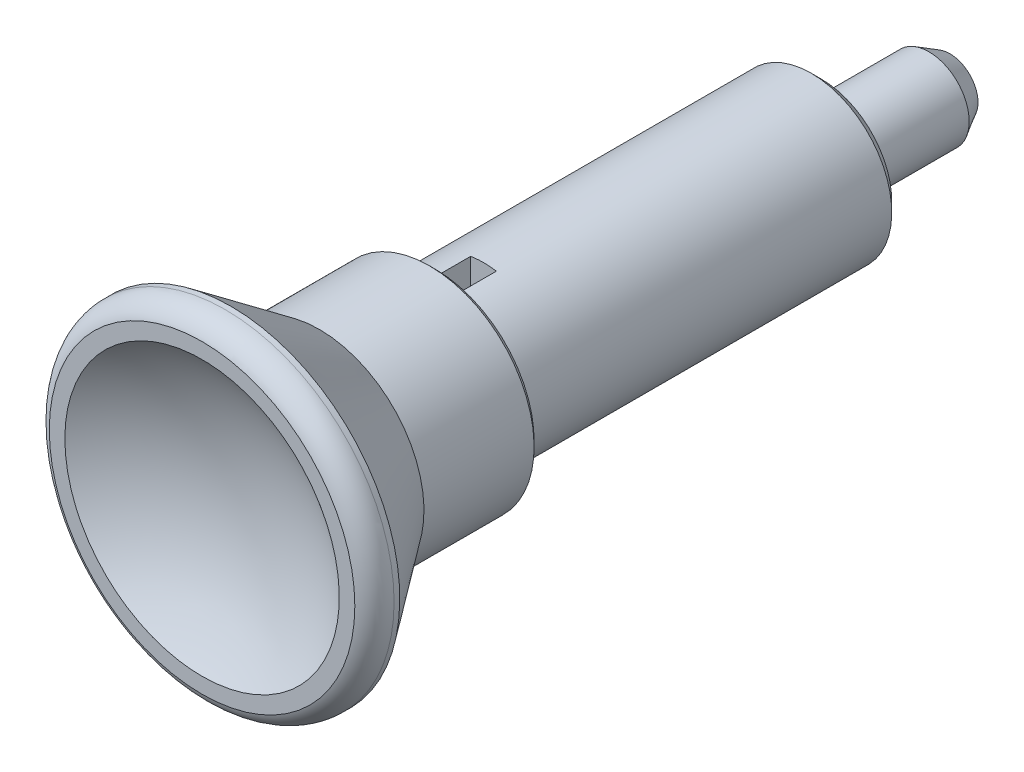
ISO-10303-21;
HEADER;
FILE_DESCRIPTION(('STEP AP214'),'2;1');
FILE_NAME('part.step','',(''),(''),'','','');
FILE_SCHEMA(('AUTOMOTIVE_DESIGN { 1 0 10303 214 1 1 1 1 }'));
ENDSEC;
DATA;
#1=APPLICATION_CONTEXT('core data for automotive mechanical design processes');
#2=APPLICATION_PROTOCOL_DEFINITION('international standard','automotive_design',2000,#1);
#3=PRODUCT_CONTEXT('',#1,'mechanical');
#4=PRODUCT('Part','Part','',(#3));
#5=PRODUCT_RELATED_PRODUCT_CATEGORY('part','',(#4));
#6=PRODUCT_DEFINITION_FORMATION('','',#4);
#7=PRODUCT_DEFINITION_CONTEXT('part definition',#1,'design');
#8=PRODUCT_DEFINITION('design','',#6,#7);
#9=PRODUCT_DEFINITION_SHAPE('','',#8);
#10=(LENGTH_UNIT() NAMED_UNIT(*) SI_UNIT(.MILLI.,.METRE.));
#11=(NAMED_UNIT(*) PLANE_ANGLE_UNIT() SI_UNIT($,.RADIAN.));
#12=(NAMED_UNIT(*) SI_UNIT($,.STERADIAN.) SOLID_ANGLE_UNIT());
#13=UNCERTAINTY_MEASURE_WITH_UNIT(LENGTH_MEASURE(1.E-05),#10,'distance_accuracy_value','');
#14=(GEOMETRIC_REPRESENTATION_CONTEXT(3) GLOBAL_UNCERTAINTY_ASSIGNED_CONTEXT((#13)) GLOBAL_UNIT_ASSIGNED_CONTEXT((#10,
#11,#12)) REPRESENTATION_CONTEXT('',''));
#15=CARTESIAN_POINT('',(0.,0.,0.));
#16=DIRECTION('',(0.,0.,1.));
#17=DIRECTION('',(1.,0.,0.));
#18=AXIS2_PLACEMENT_3D('',#15,#16,#17);
#19=CARTESIAN_POINT('',(0.8,13.,21.));
#20=DIRECTION('',(0.,0.,1.));
#21=DIRECTION('',(0.,1.,0.));
#22=AXIS2_PLACEMENT_3D('',#19,#20,#21);
#23=PLANE('',#22);
#24=DIRECTION('',(0.,-1.,0.));
#25=VECTOR('',#24,1.);
#26=CARTESIAN_POINT('',(0.8,13.,21.));
#27=LINE('',#26,#25);
#28=CARTESIAN_POINT('',(0.8,4.93558507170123,21.));
#29=VERTEX_POINT('',#28);
#30=CARTESIAN_POINT('',(0.8,2.3685438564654,21.));
#31=VERTEX_POINT('',#30);
#32=EDGE_CURVE('E88',#29,#31,#27,.T.);
#33=ORIENTED_EDGE('',*,*,#32,.F.);
#34=CARTESIAN_POINT('',(0.,0.,21.));
#35=DIRECTION('',(0.,0.,1.));
#36=DIRECTION('',(0.,1.,0.));
#37=AXIS2_PLACEMENT_3D('',#34,#35,#36);
#38=CIRCLE('',#37,5.);
#39=CARTESIAN_POINT('',(-0.8,4.93558507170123,21.));
#40=VERTEX_POINT('',#39);
#41=EDGE_CURVE('E248',#40,#29,#38,.F.);
#42=ORIENTED_EDGE('',*,*,#41,.F.);
#43=DIRECTION('',(0.,1.,0.));
#44=VECTOR('',#43,1.);
#45=CARTESIAN_POINT('',(-0.8,13.,21.));
#46=LINE('',#45,#44);
#47=CARTESIAN_POINT('',(-0.8,2.3685438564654,21.));
#48=VERTEX_POINT('',#47);
#49=EDGE_CURVE('E91',#48,#40,#46,.T.);
#50=ORIENTED_EDGE('',*,*,#49,.F.);
#51=CARTESIAN_POINT('',(0.,0.,21.));
#52=DIRECTION('',(0.,0.,1.));
#53=DIRECTION('',(0.,1.,0.));
#54=AXIS2_PLACEMENT_3D('',#51,#52,#53);
#55=CIRCLE('',#54,2.5);
#56=EDGE_CURVE('E85',#31,#48,#55,.T.);
#57=ORIENTED_EDGE('',*,*,#56,.F.);
#58=EDGE_LOOP('',(#33,#42,#50,#57));
#59=FACE_BOUND('',#58,.T.);
#60=ADVANCED_FACE('F14',(#59),#23,.T.);
#61=CARTESIAN_POINT('',(0.,0.,-8.));
#62=DIRECTION('',(0.,0.,1.));
#63=DIRECTION('',(0.,1.,0.));
#64=AXIS2_PLACEMENT_3D('',#61,#62,#63);
#65=CYLINDRICAL_SURFACE('',#64,2.5);
#66=DIRECTION('',(0.,0.,1.));
#67=VECTOR('',#66,1.);
#68=CARTESIAN_POINT('',(-0.8,2.3685438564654,21.));
#69=LINE('',#68,#67);
#70=CARTESIAN_POINT('',(-0.8,2.3685438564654,24.));
#71=VERTEX_POINT('',#70);
#72=EDGE_CURVE('E116',#71,#48,#69,.F.);
#73=ORIENTED_EDGE('',*,*,#72,.F.);
#74=CARTESIAN_POINT('',(0.,0.,24.));
#75=DIRECTION('',(0.,0.,1.));
#76=DIRECTION('',(0.,1.,0.));
#77=AXIS2_PLACEMENT_3D('',#74,#75,#76);
#78=CIRCLE('',#77,2.5);
#79=CARTESIAN_POINT('',(0.8,2.3685438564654,24.));
#80=VERTEX_POINT('',#79);
#81=EDGE_CURVE('E95',#71,#80,#78,.F.);
#82=ORIENTED_EDGE('',*,*,#81,.T.);
#83=DIRECTION('',(0.,0.,1.));
#84=VECTOR('',#83,1.);
#85=CARTESIAN_POINT('',(0.8,2.3685438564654,24.));
#86=LINE('',#85,#84);
#87=EDGE_CURVE('E99',#31,#80,#86,.T.);
#88=ORIENTED_EDGE('',*,*,#87,.F.);
#89=ORIENTED_EDGE('',*,*,#56,.T.);
#90=EDGE_LOOP('',(#73,#82,#88,#89));
#91=FACE_BOUND('',#90,.T.);
#92=ADVANCED_FACE('F100',(#91),#65,.T.);
#93=CARTESIAN_POINT('',(0.8,13.,21.));
#94=DIRECTION('',(0.,0.,1.));
#95=DIRECTION('',(0.,1.,0.));
#96=AXIS2_PLACEMENT_3D('',#93,#94,#95);
#97=PLANE('',#96);
#98=DIRECTION('',(0.,1.,0.));
#99=VECTOR('',#98,1.);
#100=CARTESIAN_POINT('',(-0.8,13.,21.));
#101=LINE('',#100,#99);
#102=CARTESIAN_POINT('',(-0.8,-4.93558507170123,21.));
#103=VERTEX_POINT('',#102);
#104=CARTESIAN_POINT('',(-0.8,-2.3685438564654,21.));
#105=VERTEX_POINT('',#104);
#106=EDGE_CURVE('E212',#103,#105,#101,.T.);
#107=ORIENTED_EDGE('',*,*,#106,.F.);
#108=CARTESIAN_POINT('',(0.,0.,21.));
#109=DIRECTION('',(0.,0.,1.));
#110=DIRECTION('',(0.,1.,0.));
#111=AXIS2_PLACEMENT_3D('',#108,#109,#110);
#112=CIRCLE('',#111,5.);
#113=CARTESIAN_POINT('',(0.8,-4.93558507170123,21.));
#114=VERTEX_POINT('',#113);
#115=EDGE_CURVE('E218',#114,#103,#112,.F.);
#116=ORIENTED_EDGE('',*,*,#115,.F.);
#117=DIRECTION('',(0.,-1.,0.));
#118=VECTOR('',#117,1.);
#119=CARTESIAN_POINT('',(0.8,13.,21.));
#120=LINE('',#119,#118);
#121=CARTESIAN_POINT('',(0.8,-2.3685438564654,21.));
#122=VERTEX_POINT('',#121);
#123=EDGE_CURVE('E215',#122,#114,#120,.T.);
#124=ORIENTED_EDGE('',*,*,#123,.F.);
#125=CARTESIAN_POINT('',(0.,0.,21.));
#126=DIRECTION('',(0.,0.,1.));
#127=DIRECTION('',(0.,1.,0.));
#128=AXIS2_PLACEMENT_3D('',#125,#126,#127);
#129=CIRCLE('',#128,2.5);
#130=EDGE_CURVE('E243',#105,#122,#129,.T.);
#131=ORIENTED_EDGE('',*,*,#130,.F.);
#132=EDGE_LOOP('',(#107,#116,#124,#131));
#133=FACE_BOUND('',#132,.T.);
#134=ADVANCED_FACE('F242',(#133),#97,.T.);
#135=CARTESIAN_POINT('',(0.,0.,-8.));
#136=DIRECTION('',(0.,0.,1.));
#137=DIRECTION('',(0.,1.,0.));
#138=AXIS2_PLACEMENT_3D('',#135,#136,#137);
#139=CYLINDRICAL_SURFACE('',#138,2.5);
#140=DIRECTION('',(0.,0.,1.));
#141=VECTOR('',#140,1.);
#142=CARTESIAN_POINT('',(-0.8,-2.3685438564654,21.));
#143=LINE('',#142,#141);
#144=CARTESIAN_POINT('',(-0.8,-2.3685438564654,24.));
#145=VERTEX_POINT('',#144);
#146=EDGE_CURVE('E209',#105,#145,#143,.T.);
#147=ORIENTED_EDGE('',*,*,#146,.F.);
#148=ORIENTED_EDGE('',*,*,#130,.T.);
#149=DIRECTION('',(0.,0.,1.));
#150=VECTOR('',#149,1.);
#151=CARTESIAN_POINT('',(0.8,-2.3685438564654,24.));
#152=LINE('',#151,#150);
#153=CARTESIAN_POINT('',(0.8,-2.3685438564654,24.));
#154=VERTEX_POINT('',#153);
#155=EDGE_CURVE('E213',#154,#122,#152,.F.);
#156=ORIENTED_EDGE('',*,*,#155,.F.);
#157=CARTESIAN_POINT('',(0.,0.,24.));
#158=DIRECTION('',(0.,0.,1.));
#159=DIRECTION('',(0.,1.,0.));
#160=AXIS2_PLACEMENT_3D('',#157,#158,#159);
#161=CIRCLE('',#160,2.5);
#162=EDGE_CURVE('E315',#154,#145,#161,.F.);
#163=ORIENTED_EDGE('',*,*,#162,.T.);
#164=EDGE_LOOP('',(#147,#148,#156,#163));
#165=FACE_BOUND('',#164,.T.);
#166=ADVANCED_FACE('F462',(#165),#139,.T.);
#167=CARTESIAN_POINT('',(0.,0.,0.));
#168=DIRECTION('',(0.,0.,1.));
#169=DIRECTION('',(0.,1.,0.));
#170=AXIS2_PLACEMENT_3D('',#167,#168,#169);
#171=CYLINDRICAL_SURFACE('',#170,5.);
#172=DIRECTION('',(0.,0.,1.));
#173=VECTOR('',#172,1.);
#174=CARTESIAN_POINT('',(0.8,-4.93558507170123,24.));
#175=LINE('',#174,#173);
#176=CARTESIAN_POINT('',(0.8,-4.93558507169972,23.3865000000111));
#177=VERTEX_POINT('',#176);
#178=EDGE_CURVE('E232',#114,#177,#175,.T.);
#179=ORIENTED_EDGE('',*,*,#178,.F.);
#180=ORIENTED_EDGE('',*,*,#115,.T.);
#181=DIRECTION('',(0.,0.,1.));
#182=VECTOR('',#181,1.);
#183=CARTESIAN_POINT('',(-0.8,-4.93558507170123,21.));
#184=LINE('',#183,#182);
#185=CARTESIAN_POINT('',(-0.8,-4.93558507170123,23.3865000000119));
#186=VERTEX_POINT('',#185);
#187=EDGE_CURVE('E211',#186,#103,#184,.F.);
#188=ORIENTED_EDGE('',*,*,#187,.F.);
#189=CARTESIAN_POINT('',(0.,0.,23.3865000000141));
#190=DIRECTION('',(0.,0.,-1.));
#191=DIRECTION('',(0.,-1.,0.));
#192=AXIS2_PLACEMENT_3D('',#189,#190,#191);
#193=CIRCLE('',#192,4.99999999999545);
#194=CARTESIAN_POINT('',(-0.8,4.93558507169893,23.3865000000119));
#195=VERTEX_POINT('',#194);
#196=EDGE_CURVE('E206',#195,#186,#193,.F.);
#197=ORIENTED_EDGE('',*,*,#196,.F.);
#198=DIRECTION('',(0.,0.,1.));
#199=VECTOR('',#198,1.);
#200=CARTESIAN_POINT('',(-0.8,4.93558507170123,21.));
#201=LINE('',#200,#199);
#202=EDGE_CURVE('E108',#40,#195,#201,.T.);
#203=ORIENTED_EDGE('',*,*,#202,.F.);
#204=ORIENTED_EDGE('',*,*,#41,.T.);
#205=DIRECTION('',(0.,0.,1.));
#206=VECTOR('',#205,1.);
#207=CARTESIAN_POINT('',(0.8,4.93558507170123,24.));
#208=LINE('',#207,#206);
#209=CARTESIAN_POINT('',(0.8,4.93558507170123,23.3865000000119));
#210=VERTEX_POINT('',#209);
#211=EDGE_CURVE('E103',#210,#29,#208,.F.);
#212=ORIENTED_EDGE('',*,*,#211,.F.);
#213=CARTESIAN_POINT('',(0.,0.,23.3865000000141));
#214=DIRECTION('',(0.,0.,-1.));
#215=DIRECTION('',(0.,-1.,0.));
#216=AXIS2_PLACEMENT_3D('',#213,#214,#215);
#217=CIRCLE('',#216,4.99999999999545);
#218=EDGE_CURVE('E229',#177,#210,#217,.F.);
#219=ORIENTED_EDGE('',*,*,#218,.F.);
#220=EDGE_LOOP('',(#179,#180,#188,#197,#203,#204,#212,#219));
#221=FACE_BOUND('',#220,.T.);
#222=CARTESIAN_POINT('',(0.,0.,0.6135));
#223=DIRECTION('',(0.,0.,1.));
#224=DIRECTION('',(0.,1.,0.));
#225=AXIS2_PLACEMENT_3D('',#222,#223,#224);
#226=CIRCLE('',#225,5.);
#227=CARTESIAN_POINT('',(0.,5.,0.6135));
#228=VERTEX_POINT('',#227);
#229=EDGE_CURVE('E96',#228,#228,#226,.T.);
#230=ORIENTED_EDGE('',*,*,#229,.T.);
#231=EDGE_LOOP('',(#230));
#232=FACE_BOUND('',#231,.T.);
#233=ADVANCED_FACE('F250',(#221,#232),#171,.T.);
#234=CARTESIAN_POINT('',(-0.8,13.,21.));
#235=DIRECTION('',(1.,0.,0.));
#236=DIRECTION('',(0.,1.,0.));
#237=AXIS2_PLACEMENT_3D('',#234,#235,#236);
#238=PLANE('',#237);
#239=ORIENTED_EDGE('',*,*,#202,.T.);
#240=CARTESIAN_POINT('',(-0.8,4.3129319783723,24.000000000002));
#241=CARTESIAN_POINT('',(-0.8,4.416807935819,23.8978519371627));
#242=CARTESIAN_POINT('',(-0.8,4.52063367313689,23.7956529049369));
#243=CARTESIAN_POINT('',(-0.8,4.72818470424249,23.5911529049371));
#244=CARTESIAN_POINT('',(-0.8,4.83190999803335,23.4888519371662));
#245=CARTESIAN_POINT('',(-0.8,4.93558507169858,23.3865000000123));
#246=B_SPLINE_CURVE_WITH_KNOTS('',3,(#240,#241,#242,#243,#244,#245),.UNSPECIFIED.,.F.,.F.,(4,2,
4),(0.,0.437058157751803,0.874116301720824),.UNSPECIFIED.);
#247=CARTESIAN_POINT('',(-0.8,4.31293197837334,24.0000000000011));
#248=VERTEX_POINT('',#247);
#249=EDGE_CURVE('E222',#248,#195,#246,.T.);
#250=ORIENTED_EDGE('',*,*,#249,.F.);
#251=DIRECTION('',(0.,1.,0.));
#252=VECTOR('',#251,1.);
#253=CARTESIAN_POINT('',(-0.8,0.,24.));
#254=LINE('',#253,#252);
#255=EDGE_CURVE('E204',#248,#71,#254,.F.);
#256=ORIENTED_EDGE('',*,*,#255,.T.);
#257=ORIENTED_EDGE('',*,*,#72,.T.);
#258=ORIENTED_EDGE('',*,*,#49,.T.);
#259=EDGE_LOOP('',(#239,#250,#256,#257,#258));
#260=FACE_BOUND('',#259,.T.);
#261=ADVANCED_FACE('F285',(#260),#238,.T.);
#262=CARTESIAN_POINT('',(0.8,13.,24.));
#263=DIRECTION('',(-1.,0.,0.));
#264=DIRECTION('',(0.,-1.,0.));
#265=AXIS2_PLACEMENT_3D('',#262,#263,#264);
#266=PLANE('',#265);
#267=CARTESIAN_POINT('',(0.8,4.93558507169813,23.3865000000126));
#268=CARTESIAN_POINT('',(0.8,4.83190999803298,23.4888519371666));
#269=CARTESIAN_POINT('',(0.8,4.7281847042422,23.5911529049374));
#270=CARTESIAN_POINT('',(0.8,4.52063367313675,23.795652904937));
#271=CARTESIAN_POINT('',(0.8,4.41680793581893,23.8978519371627));
#272=CARTESIAN_POINT('',(0.8,4.3129319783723,24.000000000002));
#273=B_SPLINE_CURVE_WITH_KNOTS('',3,(#267,#268,#269,#270,#271,#272),.UNSPECIFIED.,.F.,.F.,(4,2,
4),(0.,0.437058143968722,0.874116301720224),.UNSPECIFIED.);
#274=CARTESIAN_POINT('',(0.8,4.31293197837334,24.0000000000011));
#275=VERTEX_POINT('',#274);
#276=EDGE_CURVE('E216',#210,#275,#273,.T.);
#277=ORIENTED_EDGE('',*,*,#276,.F.);
#278=ORIENTED_EDGE('',*,*,#211,.T.);
#279=ORIENTED_EDGE('',*,*,#32,.T.);
#280=ORIENTED_EDGE('',*,*,#87,.T.);
#281=DIRECTION('',(0.,1.,0.));
#282=VECTOR('',#281,1.);
#283=CARTESIAN_POINT('',(0.8,0.,24.));
#284=LINE('',#283,#282);
#285=EDGE_CURVE('E202',#80,#275,#284,.T.);
#286=ORIENTED_EDGE('',*,*,#285,.T.);
#287=EDGE_LOOP('',(#277,#278,#279,#280,#286));
#288=FACE_BOUND('',#287,.T.);
#289=ADVANCED_FACE('F107',(#288),#266,.T.);
#290=CARTESIAN_POINT('',(0.,0.,23.3865000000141));
#291=DIRECTION('',(0.,0.,-1.));
#292=DIRECTION('',(0.,-1.,0.));
#293=AXIS2_PLACEMENT_3D('',#290,#291,#292);
#294=CONICAL_SURFACE('',#293,4.99999999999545,0.785398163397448);
#295=ORIENTED_EDGE('',*,*,#276,.T.);
#296=CARTESIAN_POINT('',(0.,0.,24.));
#297=DIRECTION('',(0.,0.,-1.));
#298=DIRECTION('',(0.,-1.,0.));
#299=AXIS2_PLACEMENT_3D('',#296,#297,#298);
#300=CIRCLE('',#299,4.38650000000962);
#301=CARTESIAN_POINT('',(0.8,-4.31293197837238,24.000000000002));
#302=VERTEX_POINT('',#301);
#303=EDGE_CURVE('E201',#275,#302,#300,.T.);
#304=ORIENTED_EDGE('',*,*,#303,.T.);
#305=CARTESIAN_POINT('',(0.8,-4.93558507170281,23.386500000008));
#306=CARTESIAN_POINT('',(0.8,-4.83190999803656,23.4888519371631));
#307=CARTESIAN_POINT('',(0.8,-4.72818470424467,23.5911529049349));
#308=CARTESIAN_POINT('',(0.8,-4.52063367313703,23.7956529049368));
#309=CARTESIAN_POINT('',(0.8,-4.4168079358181,23.8978519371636));
#310=CARTESIAN_POINT('',(0.8,-4.31293197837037,24.000000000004));
#311=B_SPLINE_CURVE_WITH_KNOTS('',3,(#305,#306,#307,#308,#309,#310),.UNSPECIFIED.,.F.,.F.,(4,2,
4),(0.,0.437058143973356,0.874116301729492),.UNSPECIFIED.);
#312=EDGE_CURVE('E228',#177,#302,#311,.T.);
#313=ORIENTED_EDGE('',*,*,#312,.F.);
#314=ORIENTED_EDGE('',*,*,#218,.T.);
#315=EDGE_LOOP('',(#295,#304,#313,#314));
#316=FACE_BOUND('',#315,.T.);
#317=ADVANCED_FACE('F255',(#316),#294,.T.);
#318=CARTESIAN_POINT('',(0.8,13.,24.));
#319=DIRECTION('',(-1.,0.,0.));
#320=DIRECTION('',(0.,-1.,0.));
#321=AXIS2_PLACEMENT_3D('',#318,#319,#320);
#322=PLANE('',#321);
#323=ORIENTED_EDGE('',*,*,#178,.T.);
#324=ORIENTED_EDGE('',*,*,#312,.T.);
#325=DIRECTION('',(0.,1.,0.));
#326=VECTOR('',#325,1.);
#327=CARTESIAN_POINT('',(0.8,0.,24.));
#328=LINE('',#327,#326);
#329=EDGE_CURVE('E198',#302,#154,#328,.T.);
#330=ORIENTED_EDGE('',*,*,#329,.T.);
#331=ORIENTED_EDGE('',*,*,#155,.T.);
#332=ORIENTED_EDGE('',*,*,#123,.T.);
#333=EDGE_LOOP('',(#323,#324,#330,#331,#332));
#334=FACE_BOUND('',#333,.T.);
#335=ADVANCED_FACE('F237',(#334),#322,.T.);
#336=CARTESIAN_POINT('',(-0.8,13.,21.));
#337=DIRECTION('',(1.,0.,0.));
#338=DIRECTION('',(0.,1.,0.));
#339=AXIS2_PLACEMENT_3D('',#336,#337,#338);
#340=PLANE('',#339);
#341=CARTESIAN_POINT('',(-0.8,-4.93558507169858,23.3865000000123));
#342=CARTESIAN_POINT('',(-0.8,-4.83190999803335,23.4888519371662));
#343=CARTESIAN_POINT('',(-0.8,-4.72818470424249,23.5911529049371));
#344=CARTESIAN_POINT('',(-0.8,-4.52063367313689,23.7956529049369));
#345=CARTESIAN_POINT('',(-0.8,-4.416807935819,23.8978519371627));
#346=CARTESIAN_POINT('',(-0.8,-4.3129319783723,24.000000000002));
#347=B_SPLINE_CURVE_WITH_KNOTS('',3,(#341,#342,#343,#344,#345,#346),.UNSPECIFIED.,.F.,.F.,(4,2,
4),(0.,0.437058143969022,0.874116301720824),.UNSPECIFIED.);
#348=CARTESIAN_POINT('',(-0.8,-4.31293197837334,24.0000000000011));
#349=VERTEX_POINT('',#348);
#350=EDGE_CURVE('E225',#186,#349,#347,.T.);
#351=ORIENTED_EDGE('',*,*,#350,.F.);
#352=ORIENTED_EDGE('',*,*,#187,.T.);
#353=ORIENTED_EDGE('',*,*,#106,.T.);
#354=ORIENTED_EDGE('',*,*,#146,.T.);
#355=DIRECTION('',(0.,1.,0.));
#356=VECTOR('',#355,1.);
#357=CARTESIAN_POINT('',(-0.8,0.,24.));
#358=LINE('',#357,#356);
#359=EDGE_CURVE('E33',#145,#349,#358,.F.);
#360=ORIENTED_EDGE('',*,*,#359,.T.);
#361=EDGE_LOOP('',(#351,#352,#353,#354,#360));
#362=FACE_BOUND('',#361,.T.);
#363=ADVANCED_FACE('F298',(#362),#340,.T.);
#364=CARTESIAN_POINT('',(0.,0.,23.3865000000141));
#365=DIRECTION('',(0.,0.,-1.));
#366=DIRECTION('',(0.,-1.,0.));
#367=AXIS2_PLACEMENT_3D('',#364,#365,#366);
#368=CONICAL_SURFACE('',#367,4.99999999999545,0.785398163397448);
#369=ORIENTED_EDGE('',*,*,#249,.T.);
#370=ORIENTED_EDGE('',*,*,#196,.T.);
#371=ORIENTED_EDGE('',*,*,#350,.T.);
#372=CARTESIAN_POINT('',(0.,0.,24.));
#373=DIRECTION('',(0.,0.,-1.));
#374=DIRECTION('',(0.,-1.,0.));
#375=AXIS2_PLACEMENT_3D('',#372,#373,#374);
#376=CIRCLE('',#375,4.38650000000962);
#377=EDGE_CURVE('E143',#349,#248,#376,.T.);
#378=ORIENTED_EDGE('',*,*,#377,.T.);
#379=EDGE_LOOP('',(#369,#370,#371,#378));
#380=FACE_BOUND('',#379,.T.);
#381=ADVANCED_FACE('F165',(#380),#368,.T.);
#382=CARTESIAN_POINT('',(0.,0.,49.6));
#383=DIRECTION('',(1.,0.,0.));
#384=DIRECTION('',(0.,-1.,0.));
#385=AXIS2_PLACEMENT_3D('',#382,#383,#384);
#386=SPHERICAL_SURFACE('',#385,14.);
#387=CARTESIAN_POINT('',(0.,-8.53170557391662,38.5));
#388=CARTESIAN_POINT('',(0.239701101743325,-8.5317072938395,38.5));
#389=CARTESIAN_POINT('',(0.47937397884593,-8.52159969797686,38.5));
#390=CARTESIAN_POINT('',(0.957096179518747,-8.48123987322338,38.5));
#391=CARTESIAN_POINT('',(1.19514505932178,-8.45098234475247,38.5));
#392=CARTESIAN_POINT('',(1.66809840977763,-8.37048717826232,38.5));
#393=CARTESIAN_POINT('',(1.90299924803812,-8.3202282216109,38.5));
#394=CARTESIAN_POINT('',(2.36773233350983,-8.20008811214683,38.5));
#395=CARTESIAN_POINT('',(2.59756451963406,-8.13020672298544,38.5));
#396=CARTESIAN_POINT('',(3.05040854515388,-7.97135842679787,38.5));
#397=CARTESIAN_POINT('',(3.27342368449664,-7.88240092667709,38.5));
#398=CARTESIAN_POINT('',(3.71116976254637,-7.68601114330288,38.5));
#399=CARTESIAN_POINT('',(3.92590057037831,-7.57857856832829,38.5));
#400=CARTESIAN_POINT('',(4.34545679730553,-7.34605366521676,38.5));
#401=CARTESIAN_POINT('',(4.55028643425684,-7.22096894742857,38.5));
#402=CARTESIAN_POINT('',(4.94875279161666,-6.95394741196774,38.5));
#403=CARTESIAN_POINT('',(5.1423856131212,-6.81200477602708,38.5));
#404=CARTESIAN_POINT('',(5.51699044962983,-6.5123226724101,38.5));
#405=CARTESIAN_POINT('',(5.69796342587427,-6.35458440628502,38.5));
#406=CARTESIAN_POINT('',(6.04598097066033,-6.02442080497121,38.5));
#407=CARTESIAN_POINT('',(6.21302532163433,-5.85199524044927,38.5));
#408=CARTESIAN_POINT('',(6.53199815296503,-5.493681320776,38.5));
#409=CARTESIAN_POINT('',(6.6839263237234,-5.30779269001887,38.5));
#410=CARTESIAN_POINT('',(6.97158596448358,-4.92387306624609,38.5));
#411=CARTESIAN_POINT('',(7.10731707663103,-4.72584180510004,38.5));
#412=CARTESIAN_POINT('',(7.36158785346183,-4.31908993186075,38.5));
#413=CARTESIAN_POINT('',(7.48013099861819,-4.11037149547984,38.5));
#414=CARTESIAN_POINT('',(7.69925411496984,-3.68361770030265,38.5));
#415=CARTESIAN_POINT('',(7.79982785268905,-3.46557914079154,38.5));
#416=CARTESIAN_POINT('',(7.98222972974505,-3.02184395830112,38.5));
#417=CARTESIAN_POINT('',(8.06406129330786,-2.79614874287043,38.5));
#418=CARTESIAN_POINT('',(8.20842175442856,-2.33866337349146,38.5));
#419=CARTESIAN_POINT('',(8.27095035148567,-2.10687312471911,38.5));
#420=CARTESIAN_POINT('',(8.37625770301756,-1.63885297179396,38.5));
#421=CARTESIAN_POINT('',(8.41903679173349,-1.40262314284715,38.5));
#422=CARTESIAN_POINT('',(8.48454328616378,-0.927394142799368,38.5));
#423=CARTESIAN_POINT('',(8.5072702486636,-0.688394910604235,38.5));
#424=CARTESIAN_POINT('',(8.53250695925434,-0.209376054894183,38.5));
#425=CARTESIAN_POINT('',(8.53502046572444,0.0306433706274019,38.5));
#426=CARTESIAN_POINT('',(8.51981962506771,0.510124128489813,38.5));
#427=CARTESIAN_POINT('',(8.50209827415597,0.749585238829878,38.5));
#428=CARTESIAN_POINT('',(8.44654739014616,1.22611973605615,38.5));
#429=CARTESIAN_POINT('',(8.40872148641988,1.46319354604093,38.5));
#430=CARTESIAN_POINT('',(8.31323191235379,1.93331562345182,38.5));
#431=CARTESIAN_POINT('',(8.25556793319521,2.16636382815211,38.5));
#432=CARTESIAN_POINT('',(8.12081350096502,2.62676991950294,38.5));
#433=CARTESIAN_POINT('',(8.04372339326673,2.85412790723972,38.5));
#434=CARTESIAN_POINT('',(7.87066231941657,3.30154649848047,38.5));
#435=CARTESIAN_POINT('',(7.77469093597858,3.52160694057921,38.5));
#436=CARTESIAN_POINT('',(7.56457013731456,3.95282077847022,38.5));
#437=CARTESIAN_POINT('',(7.45042407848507,4.16397580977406,38.5));
#438=CARTESIAN_POINT('',(7.20470986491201,4.57599267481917,38.5));
#439=CARTESIAN_POINT('',(7.07313569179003,4.77685091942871,38.5));
#440=CARTESIAN_POINT('',(6.79355690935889,5.16673175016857,38.5));
#441=CARTESIAN_POINT('',(6.64555528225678,5.35575647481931,38.5));
#442=CARTESIAN_POINT('',(6.33415193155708,5.72066897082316,38.5));
#443=CARTESIAN_POINT('',(6.17074996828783,5.89655653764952,38.5));
#444=CARTESIAN_POINT('',(5.82971281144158,6.23393780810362,38.5));
#445=CARTESIAN_POINT('',(5.65207788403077,6.3954317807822,38.5));
#446=CARTESIAN_POINT('',(5.28383088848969,6.70288487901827,38.5));
#447=CARTESIAN_POINT('',(5.09321853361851,6.84884366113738,38.5));
#448=CARTESIAN_POINT('',(4.70041160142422,7.1241591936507,38.5));
#449=CARTESIAN_POINT('',(4.49821916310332,7.25351899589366,38.5));
#450=CARTESIAN_POINT('',(4.08358517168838,7.49479054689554,38.5));
#451=CARTESIAN_POINT('',(3.87114009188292,7.60669623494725,38.5));
#452=CARTESIAN_POINT('',(3.43761429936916,7.81219183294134,38.5));
#453=CARTESIAN_POINT('',(3.21653509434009,7.90578492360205,38.5));
#454=CARTESIAN_POINT('',(2.76727776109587,8.07401431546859,38.5));
#455=CARTESIAN_POINT('',(2.53909962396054,8.14865059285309,38.5));
#456=CARTESIAN_POINT('',(2.07727024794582,8.27843463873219,38.5));
#457=CARTESIAN_POINT('',(1.84361908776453,8.33358268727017,38.5));
#458=CARTESIAN_POINT('',(1.37249510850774,8.42400095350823,38.5));
#459=CARTESIAN_POINT('',(1.13502218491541,8.45927062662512,38.5));
#460=CARTESIAN_POINT('',(0.657949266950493,8.50967905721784,38.5));
#461=CARTESIAN_POINT('',(0.4183492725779,8.52481781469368,38.5));
#462=CARTESIAN_POINT('',(-0.0612677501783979,8.53485664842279,38.5));
#463=CARTESIAN_POINT('',(-0.301284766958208,8.52975727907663,38.5));
#464=CARTESIAN_POINT('',(-0.780039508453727,8.49935713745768,38.5));
#465=CARTESIAN_POINT('',(-1.01877721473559,8.47405607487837,38.5));
#466=CARTESIAN_POINT('',(-1.49327224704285,8.40343211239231,38.5));
#467=CARTESIAN_POINT('',(-1.72902957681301,8.3581092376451,38.5));
#468=CARTESIAN_POINT('',(-2.19592874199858,8.24775425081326,38.5));
#469=CARTESIAN_POINT('',(-2.42706976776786,8.18271871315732,38.5));
#470=CARTESIAN_POINT('',(-2.88297114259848,8.0334295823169,38.5));
#471=CARTESIAN_POINT('',(-3.10773367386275,7.94918265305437,38.5));
#472=CARTESIAN_POINT('',(-3.54940485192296,7.76203966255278,38.5));
#473=CARTESIAN_POINT('',(-3.76631204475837,7.65914016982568,38.5));
#474=CARTESIAN_POINT('',(-4.1906820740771,7.43543649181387,38.5));
#475=CARTESIAN_POINT('',(-4.39814511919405,7.31463270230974,38.5));
#476=CARTESIAN_POINT('',(-4.80216087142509,7.0559751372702,38.5));
#477=CARTESIAN_POINT('',(-4.99871337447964,6.91812104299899,38.5));
#478=CARTESIAN_POINT('',(-5.37950346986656,6.62634702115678,38.5));
#479=CARTESIAN_POINT('',(-5.56374125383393,6.47242734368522,38.5));
#480=CARTESIAN_POINT('',(-5.91862768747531,6.14958531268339,38.5));
#481=CARTESIAN_POINT('',(-6.08927386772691,5.98066024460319,38.5));
#482=CARTESIAN_POINT('',(-6.41566976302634,5.62909362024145,38.5));
#483=CARTESIAN_POINT('',(-6.57142461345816,5.44645683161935,38.5));
#484=CARTESIAN_POINT('',(-6.86702506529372,5.06867846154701,38.5));
#485=CARTESIAN_POINT('',(-7.00686772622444,4.873534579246,38.5));
#486=CARTESIAN_POINT('',(-7.26961345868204,4.47216416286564,38.5));
#487=CARTESIAN_POINT('',(-7.39251690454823,4.26593787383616,38.5));
#488=CARTESIAN_POINT('',(-7.62051616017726,3.84386102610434,38.5));
#489=CARTESIAN_POINT('',(-7.72561165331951,3.62801029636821,38.5));
#490=CARTESIAN_POINT('',(-7.91724365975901,3.18822603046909,38.5));
#491=CARTESIAN_POINT('',(-8.00378046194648,2.96429262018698,38.5));
#492=CARTESIAN_POINT('',(-8.15769585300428,2.5098907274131,38.5));
#493=CARTESIAN_POINT('',(-8.22507098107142,2.27942107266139,38.5));
#494=CARTESIAN_POINT('',(-8.34014309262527,1.8137052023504,38.5));
#495=CARTESIAN_POINT('',(-8.38784687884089,1.57846066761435,38.5));
#496=CARTESIAN_POINT('',(-8.46327786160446,1.10474543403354,38.5));
#497=CARTESIAN_POINT('',(-8.49100134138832,0.866274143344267,38.5));
#498=CARTESIAN_POINT('',(-8.52625974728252,0.387849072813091,38.5));
#499=CARTESIAN_POINT('',(-8.53379511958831,0.147895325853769,38.5));
#500=CARTESIAN_POINT('',(-8.5286249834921,-0.331798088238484,38.5));
#501=CARTESIAN_POINT('',(-8.51591913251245,-0.571537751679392,38.5));
#502=CARTESIAN_POINT('',(-8.4703566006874,-1.04909074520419,38.5));
#503=CARTESIAN_POINT('',(-8.43750023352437,-1.28690410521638,38.5));
#504=CARTESIAN_POINT('',(-8.35186267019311,-1.75896084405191,38.5));
#505=CARTESIAN_POINT('',(-8.29907783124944,-1.99320356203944,38.5));
#506=CARTESIAN_POINT('',(-8.17398097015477,-2.45632829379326,38.5));
#507=CARTESIAN_POINT('',(-8.10167571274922,-2.68521213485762,38.5));
#508=CARTESIAN_POINT('',(-7.93802712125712,-3.1361221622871,38.5));
#509=CARTESIAN_POINT('',(-7.84667992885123,-3.35814694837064,38.5));
#510=CARTESIAN_POINT('',(-7.64560805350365,-3.79370687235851,38.5));
#511=CARTESIAN_POINT('',(-7.53588377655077,-4.00724219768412,38.5));
#512=CARTESIAN_POINT('',(-7.29883882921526,-4.42430601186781,38.5));
#513=CARTESIAN_POINT('',(-7.1715185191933,-4.62783470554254,38.5));
#514=CARTESIAN_POINT('',(-6.90018708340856,-5.02343989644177,38.5));
#515=CARTESIAN_POINT('',(-6.75617621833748,-5.21551657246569,38.5));
#516=CARTESIAN_POINT('',(-6.45247425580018,-5.58686986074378,38.5));
#517=CARTESIAN_POINT('',(-6.29278196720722,-5.76614549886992,38.5));
#518=CARTESIAN_POINT('',(-5.95891965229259,-6.11054627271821,38.5));
#519=CARTESIAN_POINT('',(-5.78475465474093,-6.27567628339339,38.5));
#520=CARTESIAN_POINT('',(-5.42305871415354,-6.5907497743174,38.5));
#521=CARTESIAN_POINT('',(-5.23552205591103,-6.74068669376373,38.5));
#522=CARTESIAN_POINT('',(-4.84848604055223,-7.02422451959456,38.5));
#523=CARTESIAN_POINT('',(-4.64898687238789,-7.15782568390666,38.5));
#524=CARTESIAN_POINT('',(-4.23934049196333,-7.40780635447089,38.5));
#525=CARTESIAN_POINT('',(-4.02918808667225,-7.5241773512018,38.5));
#526=CARTESIAN_POINT('',(-3.59982553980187,-7.73878930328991,38.5));
#527=CARTESIAN_POINT('',(-3.38061550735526,-7.83703047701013,38.5));
#528=CARTESIAN_POINT('',(-2.93492880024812,-8.01459089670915,38.5));
#529=CARTESIAN_POINT('',(-2.7084601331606,-8.09393023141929,38.5));
#530=CARTESIAN_POINT('',(-2.24972197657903,-8.23323823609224,38.5));
#531=CARTESIAN_POINT('',(-2.01745402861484,-8.29321199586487,38.5));
#532=CARTESIAN_POINT('',(-1.49030380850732,-8.40586518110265,38.5));
#533=CARTESIAN_POINT('',(-1.1942237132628,-8.45301528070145,38.5));
#534=CARTESIAN_POINT('',(-0.598747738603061,-8.51593440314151,38.5));
#535=CARTESIAN_POINT('',(-0.29935185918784,-8.53170342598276,38.5));
#536=CARTESIAN_POINT('',(0.,-8.53170557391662,38.5));
#537=B_SPLINE_CURVE_WITH_KNOTS('',3,(#387,#388,#389,#390,#391,#392,#393,#394,#395,#396,#397,
#398,#399,#400,#401,#402,#403,#404,#405,#406,#407,#408,#409,#410,#411,#412,#413,#414,#415,#416,
#417,#418,#419,#420,#421,#422,#423,#424,#425,#426,#427,#428,#429,#430,#431,#432,#433,#434,#435,
#436,#437,#438,#439,#440,#441,#442,#443,#444,#445,#446,#447,#448,#449,#450,#451,#452,#453,#454,
#455,#456,#457,#458,#459,#460,#461,#462,#463,#464,#465,#466,#467,#468,#469,#470,#471,#472,#473,
#474,#475,#476,#477,#478,#479,#480,#481,#482,#483,#484,#485,#486,#487,#488,#489,#490,#491,#492,
#493,#494,#495,#496,#497,#498,#499,#500,#501,#502,#503,#504,#505,#506,#507,#508,#509,#510,#511,
#512,#513,#514,#515,#516,#517,#518,#519,#520,#521,#522,#523,#524,#525,#526,#527,#528,#529,#530,
#531,#532,#533,#534,#535,#536),.UNSPECIFIED.,.T.,.F.,(4,2,2,2,2,2,2,2,2,2,2,2,2,2,2,2,2,2,2,2,2,
2,2,2,2,2,2,2,2,2,2,2,2,2,2,2,2,2,2,2,2,2,2,2,2,2,2,2,2,2,2,2,2,2,2,2,2,2,2,2,2,2,2,2,2,2,2,2,2,
2,2,2,2,2,4),(0.,0.718841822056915,1.43787277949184,2.15767218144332,2.87748025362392,
3.59693418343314,4.31639947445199,5.03555552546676,5.75496050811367,6.47431080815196,
7.19367234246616,7.9130486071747,8.63244076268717,9.35168704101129,10.0711823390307,
10.790546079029,11.5099210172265,12.2292837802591,12.9486624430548,13.6679073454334,
14.387401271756,15.1067653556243,15.8261406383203,16.5455031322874,17.2648815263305,
17.9841272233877,18.7036219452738,19.422986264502,20.1423617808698,20.8617238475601,
21.5811018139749,22.3003473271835,23.0198420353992,23.7392116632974,24.4585821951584,
25.1779423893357,25.8973222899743,26.616702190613,27.3360623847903,28.0554329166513,
28.7748025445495,29.4942972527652,30.2135427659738,30.9329207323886,31.6522827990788,
32.3716583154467,33.0910226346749,33.8105173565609,34.5297630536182,35.2491414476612,
35.9685039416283,36.6878792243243,37.4072433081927,38.1267372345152,38.8459821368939,
39.5653607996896,40.2847235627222,41.0040985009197,41.7234622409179,42.4429575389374,
43.1622038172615,43.881595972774,44.6009722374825,45.3203337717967,46.039684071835,
46.7590890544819,47.4782451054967,48.1977103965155,48.9171643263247,49.6369723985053,
50.3567718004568,51.0758027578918,51.7946445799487,52.6923736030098,53.5901026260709),.UNSPECIFIED.);
#538=CARTESIAN_POINT('',(0.,-8.53170557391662,38.5));
#539=VERTEX_POINT('',#538);
#540=EDGE_CURVE('E135',#539,#539,#537,.T.);
#541=ORIENTED_EDGE('',*,*,#540,.T.);
#542=EDGE_LOOP('',(#541));
#543=FACE_BOUND('',#542,.T.);
#544=ADVANCED_FACE('F145',(#543),#386,.F.);
#545=CARTESIAN_POINT('',(-6.14644660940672,0.,24.));
#546=DIRECTION('',(0.,0.,1.));
#547=DIRECTION('',(0.,1.,0.));
#548=AXIS2_PLACEMENT_3D('',#545,#546,#547);
#549=PLANE('',#548);
#550=CARTESIAN_POINT('',(0.,0.,24.));
#551=DIRECTION('',(0.,0.,1.));
#552=DIRECTION('',(0.,1.,0.));
#553=AXIS2_PLACEMENT_3D('',#550,#551,#552);
#554=CIRCLE('',#553,6.14644660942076);
#555=CARTESIAN_POINT('',(0.,6.14644660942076,24.));
#556=VERTEX_POINT('',#555);
#557=EDGE_CURVE('E132',#556,#556,#554,.T.);
#558=ORIENTED_EDGE('',*,*,#557,.F.);
#559=EDGE_LOOP('',(#558));
#560=FACE_BOUND('',#559,.T.);
#561=ORIENTED_EDGE('',*,*,#359,.F.);
#562=ORIENTED_EDGE('',*,*,#162,.F.);
#563=ORIENTED_EDGE('',*,*,#329,.F.);
#564=ORIENTED_EDGE('',*,*,#303,.F.);
#565=ORIENTED_EDGE('',*,*,#285,.F.);
#566=ORIENTED_EDGE('',*,*,#81,.F.);
#567=ORIENTED_EDGE('',*,*,#255,.F.);
#568=ORIENTED_EDGE('',*,*,#377,.F.);
#569=EDGE_LOOP('',(#561,#562,#563,#564,#565,#566,#567,#568));
#570=FACE_BOUND('',#569,.T.);
#571=ADVANCED_FACE('F155',(#560,#570),#549,.F.);
#572=CARTESIAN_POINT('',(-8.53170557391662,0.,38.5));
#573=DIRECTION('',(0.,0.,-1.));
#574=DIRECTION('',(0.,-1.,0.));
#575=AXIS2_PLACEMENT_3D('',#572,#573,#574);
#576=PLANE('',#575);
#577=ORIENTED_EDGE('',*,*,#540,.F.);
#578=EDGE_LOOP('',(#577));
#579=FACE_BOUND('',#578,.T.);
#580=CARTESIAN_POINT('',(0.,0.,38.5));
#581=DIRECTION('',(0.,0.,-1.));
#582=DIRECTION('',(0.,-1.,0.));
#583=AXIS2_PLACEMENT_3D('',#580,#581,#582);
#584=CIRCLE('',#583,9.50000000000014);
#585=CARTESIAN_POINT('',(0.,-9.50000000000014,38.5));
#586=VERTEX_POINT('',#585);
#587=EDGE_CURVE('E128',#586,#586,#584,.T.);
#588=ORIENTED_EDGE('',*,*,#587,.F.);
#589=EDGE_LOOP('',(#588));
#590=FACE_BOUND('',#589,.T.);
#591=ADVANCED_FACE('F150',(#579,#590),#576,.F.);
#592=CARTESIAN_POINT('',(0.,0.,24.3535533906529));
#593=DIRECTION('',(0.,0.,1.));
#594=DIRECTION('',(0.,1.,0.));
#595=AXIS2_PLACEMENT_3D('',#592,#593,#594);
#596=CONICAL_SURFACE('',#595,6.50000000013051,0.785398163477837);
#597=CARTESIAN_POINT('',(0.,0.,24.3535533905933));
#598=DIRECTION('',(0.,0.,1.));
#599=DIRECTION('',(0.,1.,0.));
#600=AXIS2_PLACEMENT_3D('',#597,#598,#599);
#601=CIRCLE('',#600,6.5);
#602=CARTESIAN_POINT('',(0.,6.5,24.3535533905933));
#603=VERTEX_POINT('',#602);
#604=EDGE_CURVE('E131',#603,#603,#601,.T.);
#605=ORIENTED_EDGE('',*,*,#604,.F.);
#606=EDGE_LOOP('',(#605));
#607=FACE_BOUND('',#606,.T.);
#608=ORIENTED_EDGE('',*,*,#557,.T.);
#609=EDGE_LOOP('',(#608));
#610=FACE_BOUND('',#609,.T.);
#611=ADVANCED_FACE('F154',(#607,#610),#596,.T.);
#612=CARTESIAN_POINT('',(0.,0.,37.0857085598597));
#613=DIRECTION('',(0.,0.,-1.));
#614=DIRECTION('',(0.,-1.,0.));
#615=AXIS2_PLACEMENT_3D('',#612,#613,#614);
#616=TOROIDAL_SURFACE('',#615,9.0002203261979,1.5);
#617=CARTESIAN_POINT('',(0.,0.,37.06));
#618=DIRECTION('',(0.,0.,1.));
#619=DIRECTION('',(0.,1.,0.));
#620=AXIS2_PLACEMENT_3D('',#617,#618,#619);
#621=CIRCLE('',#620,10.5);
#622=CARTESIAN_POINT('',(0.,10.5,37.06));
#623=VERTEX_POINT('',#622);
#624=EDGE_CURVE('E502',#623,#623,#621,.F.);
#625=ORIENTED_EDGE('',*,*,#624,.F.);
#626=EDGE_LOOP('',(#625));
#627=FACE_BOUND('',#626,.T.);
#628=ORIENTED_EDGE('',*,*,#587,.T.);
#629=EDGE_LOOP('',(#628));
#630=FACE_BOUND('',#629,.T.);
#631=ADVANCED_FACE('F187',(#627,#630),#616,.T.);
#632=CARTESIAN_POINT('',(0.,0.,-8.));
#633=DIRECTION('',(0.,0.,1.));
#634=DIRECTION('',(0.,1.,0.));
#635=AXIS2_PLACEMENT_3D('',#632,#633,#634);
#636=CYLINDRICAL_SURFACE('',#635,6.5);
#637=CARTESIAN_POINT('',(0.,0.,31.2));
#638=DIRECTION('',(0.,0.,1.));
#639=DIRECTION('',(0.,1.,0.));
#640=AXIS2_PLACEMENT_3D('',#637,#638,#639);
#641=CIRCLE('',#640,6.5);
#642=CARTESIAN_POINT('',(0.,6.5,31.2));
#643=VERTEX_POINT('',#642);
#644=EDGE_CURVE('E24',#643,#643,#641,.T.);
#645=ORIENTED_EDGE('',*,*,#644,.F.);
#646=EDGE_LOOP('',(#645));
#647=FACE_BOUND('',#646,.T.);
#648=ORIENTED_EDGE('',*,*,#604,.T.);
#649=EDGE_LOOP('',(#648));
#650=FACE_BOUND('',#649,.T.);
#651=ADVANCED_FACE('F181',(#647,#650),#636,.T.);
#652=CARTESIAN_POINT('',(0.,0.,-8.));
#653=DIRECTION('',(0.,0.,1.));
#654=DIRECTION('',(0.,1.,0.));
#655=AXIS2_PLACEMENT_3D('',#652,#653,#654);
#656=CYLINDRICAL_SURFACE('',#655,10.5);
#657=ORIENTED_EDGE('',*,*,#624,.T.);
#658=EDGE_LOOP('',(#657));
#659=FACE_BOUND('',#658,.T.);
#660=CARTESIAN_POINT('',(0.,0.,36.7055276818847));
#661=DIRECTION('',(0.,0.,1.));
#662=DIRECTION('',(0.,1.,0.));
#663=AXIS2_PLACEMENT_3D('',#660,#661,#662);
#664=CIRCLE('',#663,10.5);
#665=CARTESIAN_POINT('',(0.,10.5,36.7055276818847));
#666=VERTEX_POINT('',#665);
#667=EDGE_CURVE('E9',#666,#666,#664,.F.);
#668=ORIENTED_EDGE('',*,*,#667,.F.);
#669=EDGE_LOOP('',(#668));
#670=FACE_BOUND('',#669,.T.);
#671=ADVANCED_FACE('F171',(#659,#670),#656,.T.);
#672=CARTESIAN_POINT('',(0.,0.,36.7055276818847));
#673=DIRECTION('',(0.,0.,1.));
#674=DIRECTION('',(0.,1.,0.));
#675=AXIS2_PLACEMENT_3D('',#672,#673,#674);
#676=CONICAL_SURFACE('',#675,10.5,0.628318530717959);
#677=ORIENTED_EDGE('',*,*,#667,.T.);
#678=EDGE_LOOP('',(#677));
#679=FACE_BOUND('',#678,.T.);
#680=ORIENTED_EDGE('',*,*,#644,.T.);
#681=EDGE_LOOP('',(#680));
#682=FACE_BOUND('',#681,.T.);
#683=ADVANCED_FACE('F169',(#679,#682),#676,.T.);
#684=CARTESIAN_POINT('',(-1.74944465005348,0.,-8.));
#685=DIRECTION('',(0.,0.,1.));
#686=DIRECTION('',(0.,1.,0.));
#687=AXIS2_PLACEMENT_3D('',#684,#685,#686);
#688=PLANE('',#687);
#689=CARTESIAN_POINT('',(0.,0.,-7.99999999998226));
#690=DIRECTION('',(0.,0.,1.));
#691=DIRECTION('',(1.,0.,0.));
#692=AXIS2_PLACEMENT_3D('',#689,#690,#691);
#693=CIRCLE('',#692,1.749444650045);
#694=CARTESIAN_POINT('',(1.749444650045,0.,-7.99999999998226));
#695=VERTEX_POINT('',#694);
#696=EDGE_CURVE('E18',#695,#695,#693,.T.);
#697=ORIENTED_EDGE('',*,*,#696,.F.);
#698=EDGE_LOOP('',(#697));
#699=FACE_BOUND('',#698,.T.);
#700=ADVANCED_FACE('F16',(#699),#688,.F.);
#701=CARTESIAN_POINT('',(0.,0.,-6.69999999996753));
#702=DIRECTION('',(0.,0.,1.));
#703=DIRECTION('',(1.,0.,0.));
#704=AXIS2_PLACEMENT_3D('',#701,#702,#703);
#705=CONICAL_SURFACE('',#704,2.49999999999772,0.523598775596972);
#706=CARTESIAN_POINT('',(0.,0.,-6.7));
#707=DIRECTION('',(0.,0.,1.));
#708=DIRECTION('',(0.,1.,0.));
#709=AXIS2_PLACEMENT_3D('',#706,#707,#708);
#710=CIRCLE('',#709,2.5);
#711=CARTESIAN_POINT('',(0.,2.5,-6.7));
#712=VERTEX_POINT('',#711);
#713=EDGE_CURVE('E122',#712,#712,#710,.T.);
#714=ORIENTED_EDGE('',*,*,#713,.F.);
#715=EDGE_LOOP('',(#714));
#716=FACE_BOUND('',#715,.T.);
#717=ORIENTED_EDGE('',*,*,#696,.T.);
#718=EDGE_LOOP('',(#717));
#719=FACE_BOUND('',#718,.T.);
#720=ADVANCED_FACE('F179',(#716,#719),#705,.T.);
#721=CARTESIAN_POINT('',(0.,0.,-8.));
#722=DIRECTION('',(0.,0.,1.));
#723=DIRECTION('',(0.,1.,0.));
#724=AXIS2_PLACEMENT_3D('',#721,#722,#723);
#725=CYLINDRICAL_SURFACE('',#724,2.5);
#726=CARTESIAN_POINT('',(0.,0.,0.));
#727=DIRECTION('',(0.,0.,1.));
#728=DIRECTION('',(0.,1.,0.));
#729=AXIS2_PLACEMENT_3D('',#726,#727,#728);
#730=CIRCLE('',#729,2.5);
#731=CARTESIAN_POINT('',(0.,2.5,0.));
#732=VERTEX_POINT('',#731);
#733=EDGE_CURVE('E125',#732,#732,#730,.F.);
#734=ORIENTED_EDGE('',*,*,#733,.T.);
#735=EDGE_LOOP('',(#734));
#736=FACE_BOUND('',#735,.T.);
#737=ORIENTED_EDGE('',*,*,#713,.T.);
#738=EDGE_LOOP('',(#737));
#739=FACE_BOUND('',#738,.T.);
#740=ADVANCED_FACE('F324',(#736,#739),#725,.T.);
#741=CARTESIAN_POINT('',(-4.3865,0.,0.));
#742=DIRECTION('',(0.,0.,1.));
#743=DIRECTION('',(0.,1.,0.));
#744=AXIS2_PLACEMENT_3D('',#741,#742,#743);
#745=PLANE('',#744);
#746=CARTESIAN_POINT('',(0.,0.,5.59344237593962E-11));
#747=DIRECTION('',(0.,0.,1.));
#748=DIRECTION('',(0.,1.,0.));
#749=AXIS2_PLACEMENT_3D('',#746,#747,#748);
#750=CIRCLE('',#749,4.38650000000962);
#751=CARTESIAN_POINT('',(0.,4.38650000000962,5.59344237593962E-11));
#752=VERTEX_POINT('',#751);
#753=EDGE_CURVE('E119',#752,#752,#750,.T.);
#754=ORIENTED_EDGE('',*,*,#753,.F.);
#755=EDGE_LOOP('',(#754));
#756=FACE_BOUND('',#755,.T.);
#757=ORIENTED_EDGE('',*,*,#733,.F.);
#758=EDGE_LOOP('',(#757));
#759=FACE_BOUND('',#758,.T.);
#760=ADVANCED_FACE('F327',(#756,#759),#745,.F.);
#761=CARTESIAN_POINT('',(0.,0.,0.613499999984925));
#762=DIRECTION('',(0.,0.,1.));
#763=DIRECTION('',(0.,1.,0.));
#764=AXIS2_PLACEMENT_3D('',#761,#762,#763);
#765=CONICAL_SURFACE('',#764,4.99999999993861,0.785398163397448);
#766=ORIENTED_EDGE('',*,*,#229,.F.);
#767=EDGE_LOOP('',(#766));
#768=FACE_BOUND('',#767,.T.);
#769=ORIENTED_EDGE('',*,*,#753,.T.);
#770=EDGE_LOOP('',(#769));
#771=FACE_BOUND('',#770,.T.);
#772=ADVANCED_FACE('F329',(#768,#771),#765,.T.);
#773=CLOSED_SHELL('',(#60,#92,#134,#166,#233,#261,#289,#317,#335,#363,#381,#544,#571,#591,#611,
#631,#651,#671,#683,#700,#720,#740,#760,#772));
#774=MANIFOLD_SOLID_BREP('B1',#773);
#775=ADVANCED_BREP_SHAPE_REPRESENTATION('',(#18,#774),#14);
#776=SHAPE_DEFINITION_REPRESENTATION(#9,#775);
ENDSEC;
END-ISO-10303-21;
